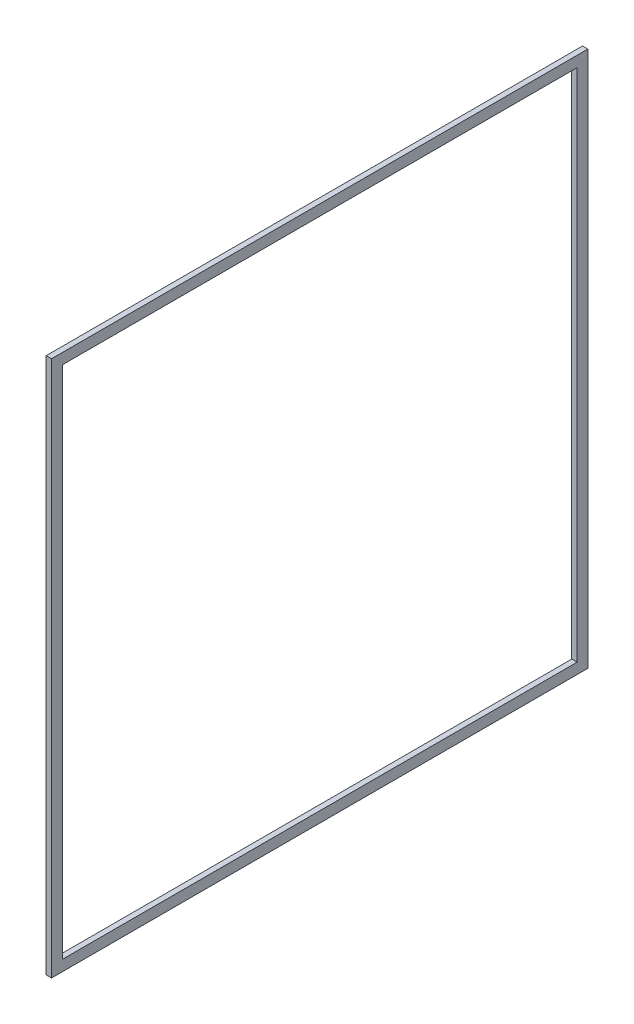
from build123d import *


with BuildPart() as part:
    # Sketch1 → Gap_bridge_0 section 0
    with BuildSketch(Plane.YZ):
        with BuildLine():
            Line((-158.75, 152.4), (158.75, 152.4))
            Line((158.75, 152.4), (158.75, 158.75))
            Line((158.75, 158.75), (-158.75, 158.75))
            Line((-158.75, 158.75), (-158.75, 152.4))
        make_face()
    # Sketch2 → Gap_bridge_0 section 1
    with BuildSketch(Plane.YZ.offset(3.175)):
        with BuildLine():
            Line((-158.75, 152.4), (158.75, 152.4))
            Line((158.75, 152.4), (158.75, 158.75))
            Line((158.75, 158.75), (-158.75, 158.75))
            Line((-158.75, 158.75), (-158.75, 152.4))
        make_face()
    loft()


with BuildPart() as body_2:
    # Sketch3 → Gap_bridge_1 section 0
    with BuildSketch(Plane.YZ):
        with BuildLine():
            Line((-158.75, -158.75), (158.75, -158.75))
            Line((158.75, -158.75), (158.75, -152.4))
            Line((158.75, -152.4), (-158.75, -152.4))
            Line((-158.75, -152.4), (-158.75, -158.75))
        make_face()
    # Sketch4 → Gap_bridge_1 section 1
    with BuildSketch(Plane.YZ.offset(3.175)):
        with BuildLine():
            Line((-158.75, -158.75), (158.75, -158.75))
            Line((158.75, -158.75), (158.75, -152.4))
            Line((158.75, -152.4), (-158.75, -152.4))
            Line((-158.75, -152.4), (-158.75, -158.75))
        make_face()
    loft()


with BuildPart() as part_1:
    add(part.part)

    add(body_2.part)  # Gap_bridge_2 merges body 2
    # Sketch5 → Gap_bridge_2 section 0
    with BuildSketch(Plane.YZ):
        with BuildLine():
            Line((152.4, -152.4), (158.75, -152.4))
            Line((158.75, -152.4), (158.75, 152.4))
            Line((158.75, 152.4), (152.4, 152.4))
            Line((152.4, 152.4), (152.4, -152.4))
        make_face()
    # Sketch6 → Gap_bridge_2 section 1
    with BuildSketch(Plane.YZ.offset(3.175)):
        with BuildLine():
            Line((152.4, -152.4), (158.75, -152.4))
            Line((158.75, -152.4), (158.75, 152.4))
            Line((158.75, 152.4), (152.4, 152.4))
            Line((152.4, 152.4), (152.4, -152.4))
        make_face()
    loft()

    # Sketch7 → Gap_bridge_3 section 0
    with BuildSketch(Plane.YZ):
        with BuildLine():
            Line((-158.75, -152.4), (-152.4, -152.4))
            Line((-152.4, -152.4), (-152.4, 152.4))
            Line((-152.4, 152.4), (-158.75, 152.4))
            Line((-158.75, 152.4), (-158.75, -152.4))
        make_face()
    # Sketch8 → Gap_bridge_3 section 1
    with BuildSketch(Plane.YZ.offset(3.175)):
        with BuildLine():
            Line((-158.75, -152.4), (-152.4, -152.4))
            Line((-152.4, -152.4), (-152.4, 152.4))
            Line((-152.4, 152.4), (-158.75, 152.4))
            Line((-158.75, 152.4), (-158.75, -152.4))
        make_face()
    loft()


solid = part_1.part
